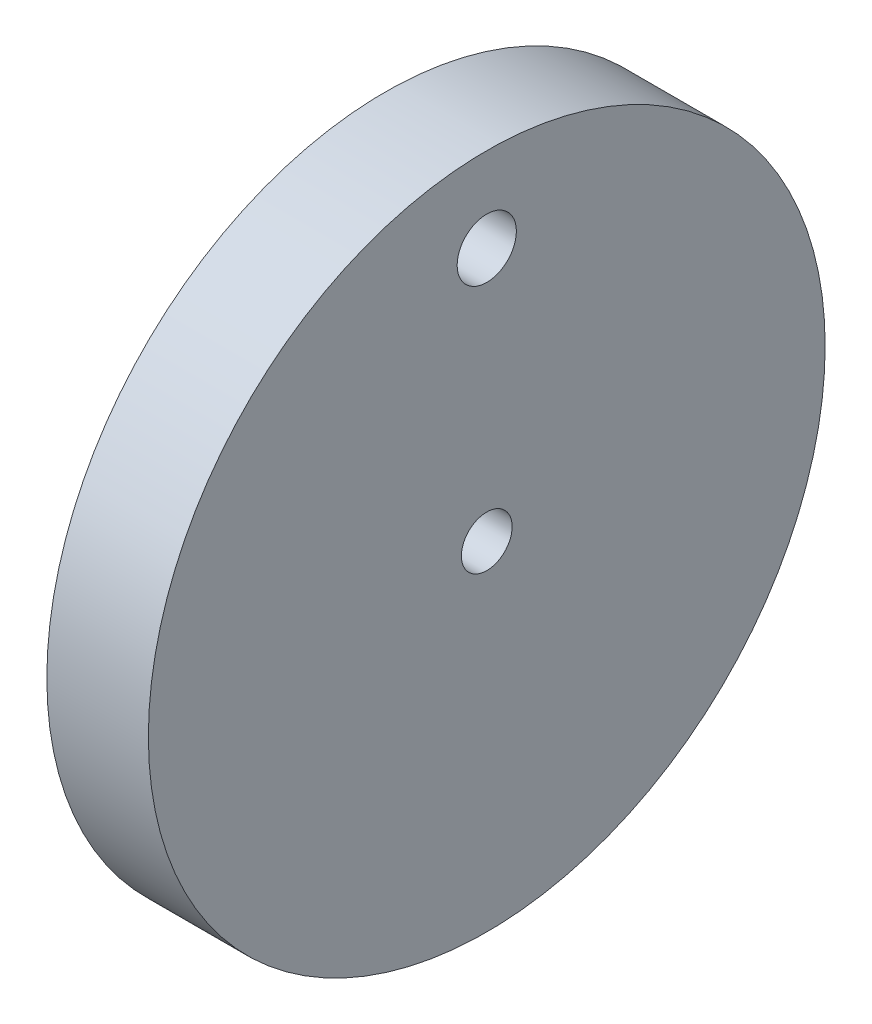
ISO-10303-21;
HEADER;
FILE_DESCRIPTION(('STEP AP214'),'2;1');
FILE_NAME('part.step','',(''),(''),'','','');
FILE_SCHEMA(('AUTOMOTIVE_DESIGN { 1 0 10303 214 1 1 1 1 }'));
ENDSEC;
DATA;
#1=APPLICATION_CONTEXT('core data for automotive mechanical design processes');
#2=APPLICATION_PROTOCOL_DEFINITION('international standard','automotive_design',2000,#1);
#3=PRODUCT_CONTEXT('',#1,'mechanical');
#4=PRODUCT('Part','Part','',(#3));
#5=PRODUCT_RELATED_PRODUCT_CATEGORY('part','',(#4));
#6=PRODUCT_DEFINITION_FORMATION('','',#4);
#7=PRODUCT_DEFINITION_CONTEXT('part definition',#1,'design');
#8=PRODUCT_DEFINITION('design','',#6,#7);
#9=PRODUCT_DEFINITION_SHAPE('','',#8);
#10=(LENGTH_UNIT() NAMED_UNIT(*) SI_UNIT(.MILLI.,.METRE.));
#11=(NAMED_UNIT(*) PLANE_ANGLE_UNIT() SI_UNIT($,.RADIAN.));
#12=(NAMED_UNIT(*) SI_UNIT($,.STERADIAN.) SOLID_ANGLE_UNIT());
#13=UNCERTAINTY_MEASURE_WITH_UNIT(LENGTH_MEASURE(1.E-05),#10,'distance_accuracy_value','');
#14=(GEOMETRIC_REPRESENTATION_CONTEXT(3) GLOBAL_UNCERTAINTY_ASSIGNED_CONTEXT((#13)) GLOBAL_UNIT_ASSIGNED_CONTEXT((#10,
#11,#12)) REPRESENTATION_CONTEXT('',''));
#15=CARTESIAN_POINT('',(0.,0.,0.));
#16=DIRECTION('',(0.,0.,1.));
#17=DIRECTION('',(1.,0.,0.));
#18=AXIS2_PLACEMENT_3D('',#15,#16,#17);
#19=CARTESIAN_POINT('',(6.,15.,0.));
#20=DIRECTION('',(-1.,0.,0.));
#21=DIRECTION('',(0.,0.,1.));
#22=AXIS2_PLACEMENT_3D('',#19,#20,#21);
#23=CYLINDRICAL_SURFACE('',#22,1.75);
#24=CARTESIAN_POINT('',(6.,15.,0.));
#25=DIRECTION('',(1.,0.,0.));
#26=DIRECTION('',(0.,0.,-1.));
#27=AXIS2_PLACEMENT_3D('',#24,#25,#26);
#28=CIRCLE('',#27,1.75);
#29=CARTESIAN_POINT('',(6.,15.,-1.75));
#30=VERTEX_POINT('',#29);
#31=EDGE_CURVE('E46',#30,#30,#28,.T.);
#32=ORIENTED_EDGE('',*,*,#31,.T.);
#33=EDGE_LOOP('',(#32));
#34=FACE_BOUND('',#33,.T.);
#35=CARTESIAN_POINT('',(3.,15.,0.));
#36=DIRECTION('',(-1.,0.,0.));
#37=DIRECTION('',(0.,0.,1.));
#38=AXIS2_PLACEMENT_3D('',#35,#36,#37);
#39=CIRCLE('',#38,1.75);
#40=CARTESIAN_POINT('',(3.,15.,1.75));
#41=VERTEX_POINT('',#40);
#42=EDGE_CURVE('E32',#41,#41,#39,.T.);
#43=ORIENTED_EDGE('',*,*,#42,.T.);
#44=EDGE_LOOP('',(#43));
#45=FACE_BOUND('',#44,.T.);
#46=ADVANCED_FACE('F28',(#34,#45),#23,.F.);
#47=CARTESIAN_POINT('',(6.,0.,0.));
#48=DIRECTION('',(1.,0.,0.));
#49=DIRECTION('',(0.,0.,-1.));
#50=AXIS2_PLACEMENT_3D('',#47,#48,#49);
#51=PLANE('',#50);
#52=CARTESIAN_POINT('',(6.,0.,0.));
#53=DIRECTION('',(1.,0.,0.));
#54=DIRECTION('',(0.,0.,-1.));
#55=AXIS2_PLACEMENT_3D('',#52,#53,#54);
#56=CIRCLE('',#55,1.5);
#57=CARTESIAN_POINT('',(6.,0.,-1.5));
#58=VERTEX_POINT('',#57);
#59=EDGE_CURVE('E41',#58,#58,#56,.T.);
#60=ORIENTED_EDGE('',*,*,#59,.F.);
#61=EDGE_LOOP('',(#60));
#62=FACE_BOUND('',#61,.T.);
#63=CARTESIAN_POINT('',(6.,0.,0.));
#64=DIRECTION('',(1.,0.,0.));
#65=DIRECTION('',(0.,0.,-1.));
#66=AXIS2_PLACEMENT_3D('',#63,#64,#65);
#67=CIRCLE('',#66,20.);
#68=CARTESIAN_POINT('',(6.,0.,-20.));
#69=VERTEX_POINT('',#68);
#70=EDGE_CURVE('E10',#69,#69,#67,.T.);
#71=ORIENTED_EDGE('',*,*,#70,.T.);
#72=EDGE_LOOP('',(#71));
#73=FACE_BOUND('',#72,.T.);
#74=ORIENTED_EDGE('',*,*,#31,.F.);
#75=EDGE_LOOP('',(#74));
#76=FACE_BOUND('',#75,.T.);
#77=ADVANCED_FACE('F73',(#62,#73,#76),#51,.T.);
#78=CARTESIAN_POINT('',(0.,0.,0.));
#79=DIRECTION('',(1.,0.,0.));
#80=DIRECTION('',(0.,0.,-1.));
#81=AXIS2_PLACEMENT_3D('',#78,#79,#80);
#82=PLANE('',#81);
#83=CARTESIAN_POINT('',(0.,15.,0.));
#84=DIRECTION('',(-1.,0.,0.));
#85=DIRECTION('',(0.,0.,1.));
#86=AXIS2_PLACEMENT_3D('',#83,#84,#85);
#87=CIRCLE('',#86,3.25);
#88=CARTESIAN_POINT('',(0.,15.,3.25));
#89=VERTEX_POINT('',#88);
#90=EDGE_CURVE('E51',#89,#89,#87,.T.);
#91=ORIENTED_EDGE('',*,*,#90,.F.);
#92=EDGE_LOOP('',(#91));
#93=FACE_BOUND('',#92,.T.);
#94=CARTESIAN_POINT('',(0.,0.,0.));
#95=DIRECTION('',(1.,0.,0.));
#96=DIRECTION('',(0.,0.,-1.));
#97=AXIS2_PLACEMENT_3D('',#94,#95,#96);
#98=CIRCLE('',#97,1.5);
#99=CARTESIAN_POINT('',(0.,0.,-1.5));
#100=VERTEX_POINT('',#99);
#101=EDGE_CURVE('E43',#100,#100,#98,.T.);
#102=ORIENTED_EDGE('',*,*,#101,.T.);
#103=EDGE_LOOP('',(#102));
#104=FACE_BOUND('',#103,.T.);
#105=CARTESIAN_POINT('',(0.,0.,0.));
#106=DIRECTION('',(1.,0.,0.));
#107=DIRECTION('',(0.,0.,-1.));
#108=AXIS2_PLACEMENT_3D('',#105,#106,#107);
#109=CIRCLE('',#108,20.);
#110=CARTESIAN_POINT('',(0.,0.,-20.));
#111=VERTEX_POINT('',#110);
#112=EDGE_CURVE('E36',#111,#111,#109,.T.);
#113=ORIENTED_EDGE('',*,*,#112,.F.);
#114=EDGE_LOOP('',(#113));
#115=FACE_BOUND('',#114,.T.);
#116=ADVANCED_FACE('F79',(#93,#104,#115),#82,.F.);
#117=CARTESIAN_POINT('',(6.,0.,0.));
#118=DIRECTION('',(-1.,0.,0.));
#119=DIRECTION('',(0.,0.,1.));
#120=AXIS2_PLACEMENT_3D('',#117,#118,#119);
#121=CYLINDRICAL_SURFACE('',#120,20.);
#122=ORIENTED_EDGE('',*,*,#70,.F.);
#123=EDGE_LOOP('',(#122));
#124=FACE_BOUND('',#123,.T.);
#125=ORIENTED_EDGE('',*,*,#112,.T.);
#126=EDGE_LOOP('',(#125));
#127=FACE_BOUND('',#126,.T.);
#128=ADVANCED_FACE('F30',(#124,#127),#121,.T.);
#129=CARTESIAN_POINT('',(6.,0.,0.));
#130=DIRECTION('',(-1.,0.,0.));
#131=DIRECTION('',(0.,0.,1.));
#132=AXIS2_PLACEMENT_3D('',#129,#130,#131);
#133=CYLINDRICAL_SURFACE('',#132,1.5);
#134=ORIENTED_EDGE('',*,*,#59,.T.);
#135=EDGE_LOOP('',(#134));
#136=FACE_BOUND('',#135,.T.);
#137=ORIENTED_EDGE('',*,*,#101,.F.);
#138=EDGE_LOOP('',(#137));
#139=FACE_BOUND('',#138,.T.);
#140=ADVANCED_FACE('F69',(#136,#139),#133,.F.);
#141=CARTESIAN_POINT('',(3.,15.,0.));
#142=DIRECTION('',(-1.,0.,0.));
#143=DIRECTION('',(0.,0.,1.));
#144=AXIS2_PLACEMENT_3D('',#141,#142,#143);
#145=CYLINDRICAL_SURFACE('',#144,3.25);
#146=CARTESIAN_POINT('',(3.,15.,0.));
#147=DIRECTION('',(-1.,0.,0.));
#148=DIRECTION('',(0.,0.,1.));
#149=AXIS2_PLACEMENT_3D('',#146,#147,#148);
#150=CIRCLE('',#149,3.25);
#151=CARTESIAN_POINT('',(3.,15.,3.25));
#152=VERTEX_POINT('',#151);
#153=EDGE_CURVE('E54',#152,#152,#150,.T.);
#154=ORIENTED_EDGE('',*,*,#153,.F.);
#155=EDGE_LOOP('',(#154));
#156=FACE_BOUND('',#155,.T.);
#157=ORIENTED_EDGE('',*,*,#90,.T.);
#158=EDGE_LOOP('',(#157));
#159=FACE_BOUND('',#158,.T.);
#160=ADVANCED_FACE('F64',(#156,#159),#145,.F.);
#161=CARTESIAN_POINT('',(3.,15.,0.));
#162=DIRECTION('',(-1.,0.,0.));
#163=DIRECTION('',(0.,0.,1.));
#164=AXIS2_PLACEMENT_3D('',#161,#162,#163);
#165=PLANE('',#164);
#166=ORIENTED_EDGE('',*,*,#42,.F.);
#167=EDGE_LOOP('',(#166));
#168=FACE_BOUND('',#167,.T.);
#169=ORIENTED_EDGE('',*,*,#153,.T.);
#170=EDGE_LOOP('',(#169));
#171=FACE_BOUND('',#170,.T.);
#172=ADVANCED_FACE('F62',(#168,#171),#165,.T.);
#173=CLOSED_SHELL('',(#46,#77,#116,#128,#140,#160,#172));
#174=MANIFOLD_SOLID_BREP('B2',#173);
#175=ADVANCED_BREP_SHAPE_REPRESENTATION('',(#18,#174),#14);
#176=SHAPE_DEFINITION_REPRESENTATION(#9,#175);
ENDSEC;
END-ISO-10303-21;
